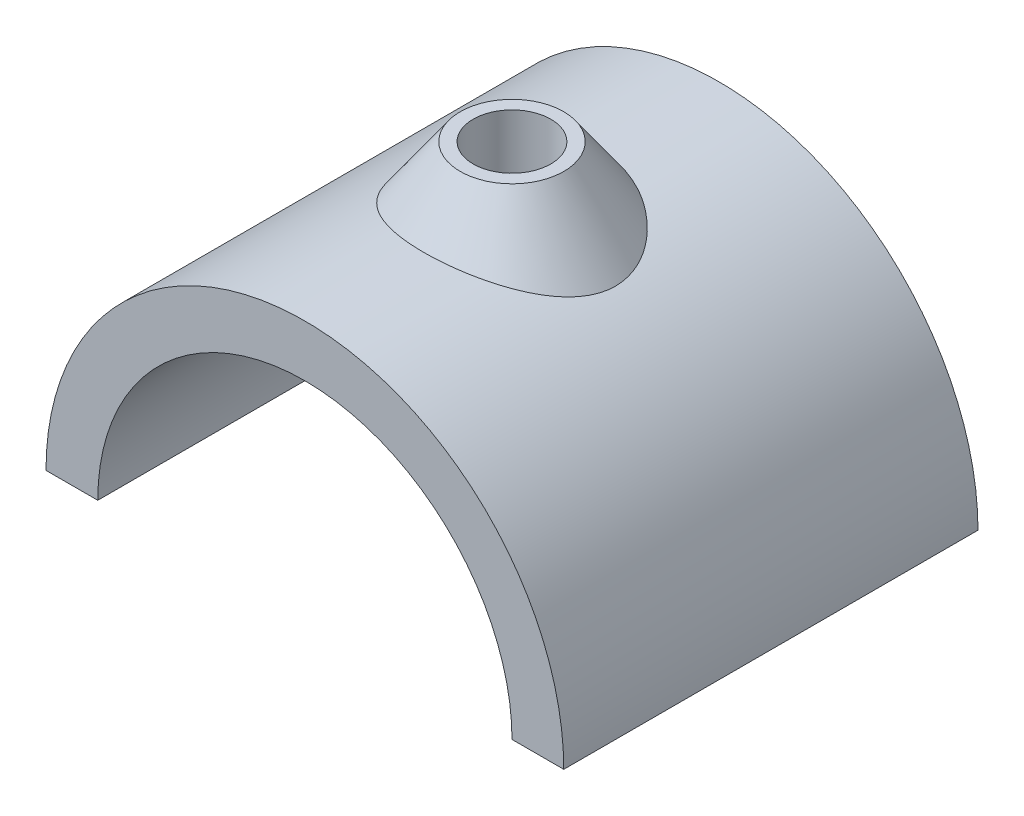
from build123d import *

# Parameters (mm, degrees)
EXTRUDE1_DEPTH      = 40
SKETCH_2_R          = 7.5
CUT_EXTRUDE_1_DEPTH = 88.74964404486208


with BuildPart() as part:
    # Sketch1 → Extrude1 (new, symmetric)
    with BuildSketch(Plane.XY):
        with BuildLine():
            Line((50, 0), (40, 0))
            ThreePointArc((40, 0), (2.45e-15, 40), (-40, 0))
            Line((-40, 0), (-50, 0))
            ThreePointArc((-50, 0), (3.06e-15, 50), (50, 0))
        make_face()
    extrude(amount=EXTRUDE1_DEPTH, both=True)

    # Sketch 1 → Revolve 1 (revolve)
    with BuildSketch(Plane.XY, mode=Mode.PRIVATE) as revolve_1_sk:
        with BuildLine():
            Line((2.7e-16, 60), (-10, 60))
            Line((-10, 60), (-20, 45.825756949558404))
            ThreePointArc((-20, 45.825756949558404), (-10.215482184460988, 48.945315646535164), (0, 50))
            Line((0, 50), (2.7e-16, 60))
        make_face()
    revolve(revolve_1_sk.sketch.rotate(Axis((0, 0, 0), (0, 1, 0)), 270), axis=Axis((0, 0, 0), (0, 1, 0)))

    # Sketch 2 → Cut-Extrude 1 (cut, through all)
    with BuildSketch(Plane(origin=(0, 60, 0), x_dir=(1, 0, 0), z_dir=(0, 1, 0))):
        with Locations(Location((0, 0, 0), (0, 0, 270))):
            Circle(SKETCH_2_R)
    extrude(amount=-CUT_EXTRUDE_1_DEPTH, mode=Mode.SUBTRACT)


solid = part.part
